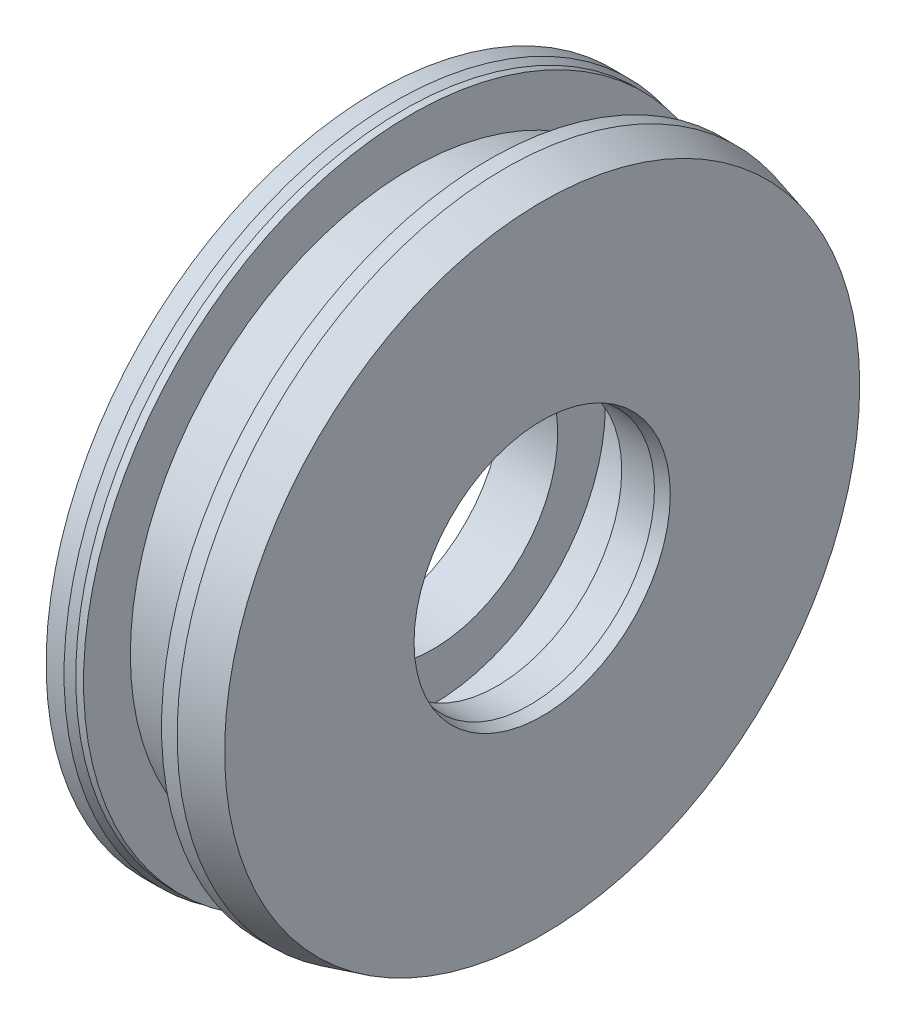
from build123d import *


with BuildPart() as part:
    # Esquisse1 → Base-R_volution (revolve)
    with BuildSketch(Plane.XY, mode=Mode.PRIVATE) as base_r_volution_sk:
        Polygon((0, 4), (1.8, 4), (1.8, 5.525), (3.85, 5.525), (3.85, 4), (4.9, 4), (5.3, 4.107179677), (5.3, 10.178460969), (4.1, 10.5), (3.6, 10.5), (3.6, 9), (1.1, 9), (1.1, 10.5), (0.85, 10.5), (0.575252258, 10.6), (0, 10.6), align=None)
    revolve(base_r_volution_sk.sketch.rotate(Axis((0, 0, 0), (-1, 0, 0)), 90), axis=Axis((0, 0, 0), (-1, 0, 0)))


solid = part.part
